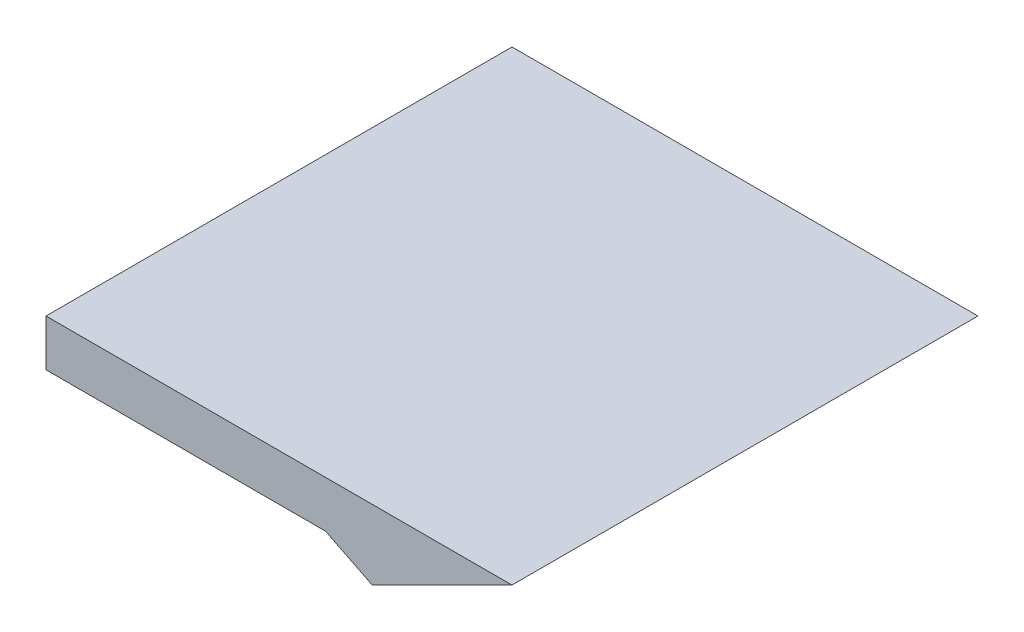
from build123d import *

# Parameters (mm, degrees)
BOSS_EXTRU_1_DEPTH = 10


with BuildPart() as part:
    # Esquisse1 → Boss.-Extru.1 (new body)
    with BuildSketch(Plane.XY):
        Polygon((-23.377129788, 0), (-17.377129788, 0), (-16.377129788, -0.5), (-13.377129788, 1), (-23.377129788, 1), align=None)
    extrude(amount=BOSS_EXTRU_1_DEPTH)


solid = part.part
